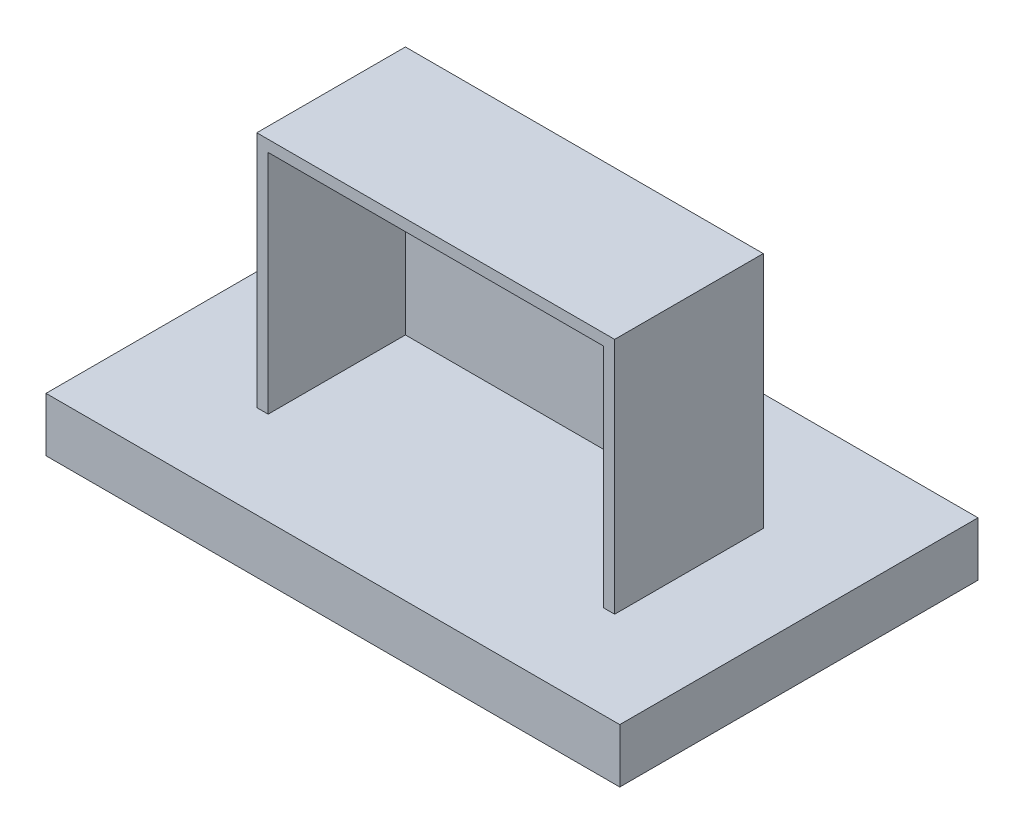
from build123d import *

# Parameters (mm, degrees)
SKETCH1_W      = 128.32723239
SKETCH1_H      = 80.122259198
EXTRUDE1_DEPTH = 12.095340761
SKETCH2_W      = 80.038954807
SKETCH2_H      = 33.236679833
EXTRUDE2_DEPTH = 53.243340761
SHELL1_T       = -2.54


with BuildPart() as part:
    # Sketch1 → Extrude1 (new body)
    with BuildSketch(Plane(origin=(0, 0, 0), x_dir=(1, 0, 0), z_dir=(0, 1, 0))):
        with Locations((64.163616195, 40.061129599)):
            Rectangle(SKETCH1_W, SKETCH1_H)
    extrude(amount=EXTRUDE1_DEPTH)


with BuildPart() as body_2:
    # Sketch2 → Extrude2 (new body)
    with BuildSketch(Plane(origin=(0, 12.095340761, 0), x_dir=(-1, 0, 0), z_dir=(0, 1, 0))):
        with Locations((-66.360074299, -37.424038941)):
            Rectangle(SKETCH2_W, SKETCH2_H)
    extrude(amount=EXTRUDE2_DEPTH)

    # Shell1
    shell1_openings = [body_2.faces().sort_by_distance(p)[0] for p in [
        (66.360074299, 12.095340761, -37.42403894),
        (66.360074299, 38.717011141, -20.805699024),
    ]]
    offset(amount=SHELL1_T, openings=shell1_openings, kind=Kind.INTERSECTION)


solid = Compound([part.part, body_2.part])
